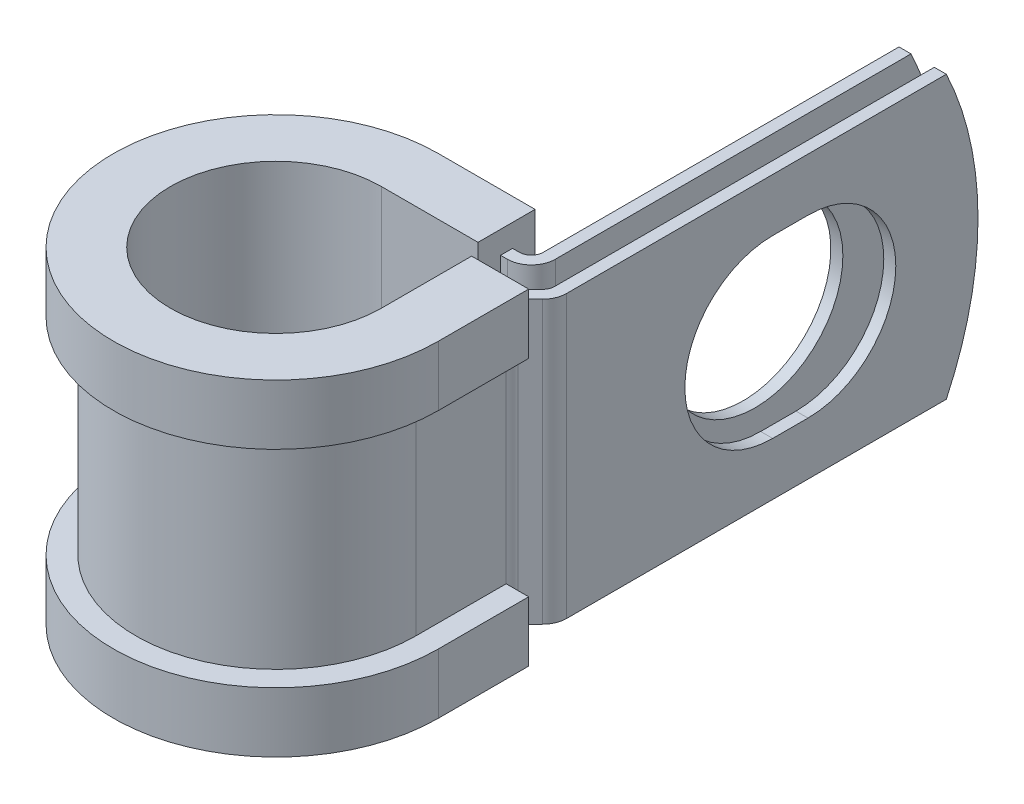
ISO-10303-21;
HEADER;
FILE_DESCRIPTION(('STEP AP214'),'2;1');
FILE_NAME('part.step','',(''),(''),'','','');
FILE_SCHEMA(('AUTOMOTIVE_DESIGN { 1 0 10303 214 1 1 1 1 }'));
ENDSEC;
DATA;
#1=APPLICATION_CONTEXT('core data for automotive mechanical design processes');
#2=APPLICATION_PROTOCOL_DEFINITION('international standard','automotive_design',2000,#1);
#3=PRODUCT_CONTEXT('',#1,'mechanical');
#4=PRODUCT('Part','Part','',(#3));
#5=PRODUCT_RELATED_PRODUCT_CATEGORY('part','',(#4));
#6=PRODUCT_DEFINITION_FORMATION('','',#4);
#7=PRODUCT_DEFINITION_CONTEXT('part definition',#1,'design');
#8=PRODUCT_DEFINITION('design','',#6,#7);
#9=PRODUCT_DEFINITION_SHAPE('','',#8);
#10=(LENGTH_UNIT() NAMED_UNIT(*) SI_UNIT(.MILLI.,.METRE.));
#11=(NAMED_UNIT(*) PLANE_ANGLE_UNIT() SI_UNIT($,.RADIAN.));
#12=(NAMED_UNIT(*) SI_UNIT($,.STERADIAN.) SOLID_ANGLE_UNIT());
#13=UNCERTAINTY_MEASURE_WITH_UNIT(LENGTH_MEASURE(1.E-05),#10,'distance_accuracy_value','');
#14=(GEOMETRIC_REPRESENTATION_CONTEXT(3) GLOBAL_UNCERTAINTY_ASSIGNED_CONTEXT((#13)) GLOBAL_UNIT_ASSIGNED_CONTEXT((#10,
#11,#12)) REPRESENTATION_CONTEXT('',''));
#15=CARTESIAN_POINT('',(0.,0.,0.));
#16=DIRECTION('',(0.,0.,1.));
#17=DIRECTION('',(1.,0.,0.));
#18=AXIS2_PLACEMENT_3D('',#15,#16,#17);
#19=CARTESIAN_POINT('',(9.38897438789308,-9.525,-8.6614));
#20=DIRECTION('',(0.,1.,0.));
#21=DIRECTION('',(1.,0.,0.));
#22=AXIS2_PLACEMENT_3D('',#19,#20,#21);
#23=PLANE('',#22);
#24=DIRECTION('',(0.,0.,-1.));
#25=VECTOR('',#24,1.);
#26=CARTESIAN_POINT('',(6.54417438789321,-9.525,-8.6614));
#27=LINE('',#26,#25);
#28=CARTESIAN_POINT('',(6.54417438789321,-9.525,-8.6614));
#29=VERTEX_POINT('',#28);
#30=CARTESIAN_POINT('',(6.54417438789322,-9.525,-9.4742));
#31=VERTEX_POINT('',#30);
#32=EDGE_CURVE('E523',#29,#31,#27,.T.);
#33=ORIENTED_EDGE('',*,*,#32,.T.);
#34=DIRECTION('',(1.,0.,0.));
#35=VECTOR('',#34,1.);
#36=CARTESIAN_POINT('',(0.,-9.525,-9.4742));
#37=LINE('',#36,#35);
#38=CARTESIAN_POINT('',(7.00137438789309,-9.525,-9.4742));
#39=VERTEX_POINT('',#38);
#40=EDGE_CURVE('E410',#39,#31,#37,.F.);
#41=ORIENTED_EDGE('',*,*,#40,.F.);
#42=CARTESIAN_POINT('',(7.00137438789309,-9.525,-10.287));
#43=DIRECTION('',(0.,1.,0.));
#44=DIRECTION('',(1.,0.,0.));
#45=AXIS2_PLACEMENT_3D('',#42,#43,#44);
#46=CIRCLE('',#45,0.8128);
#47=CARTESIAN_POINT('',(7.81417438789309,-9.525,-10.287));
#48=VERTEX_POINT('',#47);
#49=EDGE_CURVE('E408',#48,#39,#46,.F.);
#50=ORIENTED_EDGE('',*,*,#49,.F.);
#51=DIRECTION('',(0.,0.,1.));
#52=VECTOR('',#51,1.);
#53=CARTESIAN_POINT('',(7.81417438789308,-9.525,-36.4998));
#54=LINE('',#53,#52);
#55=CARTESIAN_POINT('',(7.81417438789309,-9.525,-34.3552631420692));
#56=VERTEX_POINT('',#55);
#57=EDGE_CURVE('E406',#56,#48,#54,.T.);
#58=ORIENTED_EDGE('',*,*,#57,.F.);
#59=DIRECTION('',(-1.,0.,0.));
#60=VECTOR('',#59,1.);
#61=CARTESIAN_POINT('',(11.0145743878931,-9.525,-34.3552631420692));
#62=LINE('',#61,#60);
#63=CARTESIAN_POINT('',(8.62697438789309,-9.525,-34.3552631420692));
#64=VERTEX_POINT('',#63);
#65=EDGE_CURVE('E12',#64,#56,#62,.T.);
#66=ORIENTED_EDGE('',*,*,#65,.F.);
#67=DIRECTION('',(0.,0.,1.));
#68=VECTOR('',#67,1.);
#69=CARTESIAN_POINT('',(8.62697438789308,-9.525,-36.4998));
#70=LINE('',#69,#68);
#71=CARTESIAN_POINT('',(8.62697438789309,-9.525,-10.287));
#72=VERTEX_POINT('',#71);
#73=EDGE_CURVE('E404',#64,#72,#70,.T.);
#74=ORIENTED_EDGE('',*,*,#73,.T.);
#75=CARTESIAN_POINT('',(7.00137438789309,-9.525,-10.287));
#76=DIRECTION('',(0.,-1.,0.));
#77=DIRECTION('',(0.,0.,1.));
#78=AXIS2_PLACEMENT_3D('',#75,#76,#77);
#79=CIRCLE('',#78,1.6256);
#80=CARTESIAN_POINT('',(7.00137438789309,-9.525,-8.6614));
#81=VERTEX_POINT('',#80);
#82=EDGE_CURVE('E401',#72,#81,#79,.T.);
#83=ORIENTED_EDGE('',*,*,#82,.T.);
#84=DIRECTION('',(-1.,0.,0.));
#85=VECTOR('',#84,1.);
#86=CARTESIAN_POINT('',(0.,-9.525,-8.6614));
#87=LINE('',#86,#85);
#88=EDGE_CURVE('E398',#81,#29,#87,.T.);
#89=ORIENTED_EDGE('',*,*,#88,.T.);
#90=EDGE_LOOP('',(#33,#41,#50,#58,#66,#74,#83,#89));
#91=FACE_BOUND('',#90,.T.);
#92=ADVANCED_FACE('F54',(#91),#23,.F.);
#93=CARTESIAN_POINT('',(9.38897438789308,9.525,-8.6614));
#94=DIRECTION('',(0.,1.,0.));
#95=DIRECTION('',(1.,0.,0.));
#96=AXIS2_PLACEMENT_3D('',#93,#94,#95);
#97=PLANE('',#96);
#98=DIRECTION('',(1.,0.,0.));
#99=VECTOR('',#98,1.);
#100=CARTESIAN_POINT('',(0.,9.525,-9.4742));
#101=LINE('',#100,#99);
#102=CARTESIAN_POINT('',(7.00137438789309,9.525,-9.4742));
#103=VERTEX_POINT('',#102);
#104=CARTESIAN_POINT('',(6.54417438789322,9.525,-9.4742));
#105=VERTEX_POINT('',#104);
#106=EDGE_CURVE('E368',#103,#105,#101,.F.);
#107=ORIENTED_EDGE('',*,*,#106,.T.);
#108=DIRECTION('',(0.,0.,1.));
#109=VECTOR('',#108,1.);
#110=CARTESIAN_POINT('',(6.54417438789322,9.525,-9.4742));
#111=LINE('',#110,#109);
#112=CARTESIAN_POINT('',(6.54417438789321,9.525,-8.6614));
#113=VERTEX_POINT('',#112);
#114=EDGE_CURVE('E517',#105,#113,#111,.T.);
#115=ORIENTED_EDGE('',*,*,#114,.T.);
#116=DIRECTION('',(-1.,0.,0.));
#117=VECTOR('',#116,1.);
#118=CARTESIAN_POINT('',(0.,9.525,-8.6614));
#119=LINE('',#118,#117);
#120=CARTESIAN_POINT('',(7.00137438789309,9.525,-8.6614));
#121=VERTEX_POINT('',#120);
#122=EDGE_CURVE('E625',#121,#113,#119,.T.);
#123=ORIENTED_EDGE('',*,*,#122,.F.);
#124=CARTESIAN_POINT('',(7.00137438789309,9.525,-10.287));
#125=DIRECTION('',(0.,-1.,0.));
#126=DIRECTION('',(0.,0.,1.));
#127=AXIS2_PLACEMENT_3D('',#124,#125,#126);
#128=CIRCLE('',#127,1.6256);
#129=CARTESIAN_POINT('',(8.62697438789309,9.525,-10.287));
#130=VERTEX_POINT('',#129);
#131=EDGE_CURVE('E370',#130,#121,#128,.T.);
#132=ORIENTED_EDGE('',*,*,#131,.F.);
#133=DIRECTION('',(0.,0.,1.));
#134=VECTOR('',#133,1.);
#135=CARTESIAN_POINT('',(8.62697438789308,9.525,-36.4998));
#136=LINE('',#135,#134);
#137=CARTESIAN_POINT('',(8.62697438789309,9.525,-34.3552631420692));
#138=VERTEX_POINT('',#137);
#139=EDGE_CURVE('E361',#138,#130,#136,.T.);
#140=ORIENTED_EDGE('',*,*,#139,.F.);
#141=DIRECTION('',(-1.,0.,0.));
#142=VECTOR('',#141,1.);
#143=CARTESIAN_POINT('',(11.0145743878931,9.525,-34.3552631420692));
#144=LINE('',#143,#142);
#145=CARTESIAN_POINT('',(7.81417438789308,9.525,-34.3552631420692));
#146=VERTEX_POINT('',#145);
#147=EDGE_CURVE('E62',#138,#146,#144,.T.);
#148=ORIENTED_EDGE('',*,*,#147,.T.);
#149=DIRECTION('',(0.,0.,1.));
#150=VECTOR('',#149,1.);
#151=CARTESIAN_POINT('',(7.81417438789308,9.525,-36.4998));
#152=LINE('',#151,#150);
#153=CARTESIAN_POINT('',(7.81417438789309,9.525,-10.287));
#154=VERTEX_POINT('',#153);
#155=EDGE_CURVE('E358',#146,#154,#152,.T.);
#156=ORIENTED_EDGE('',*,*,#155,.T.);
#157=CARTESIAN_POINT('',(7.00137438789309,9.525,-10.287));
#158=DIRECTION('',(0.,1.,0.));
#159=DIRECTION('',(1.,0.,0.));
#160=AXIS2_PLACEMENT_3D('',#157,#158,#159);
#161=CIRCLE('',#160,0.8128);
#162=EDGE_CURVE('E366',#154,#103,#161,.F.);
#163=ORIENTED_EDGE('',*,*,#162,.T.);
#164=EDGE_LOOP('',(#107,#115,#123,#132,#140,#148,#156,#163));
#165=FACE_BOUND('',#164,.T.);
#166=ADVANCED_FACE('F357',(#165),#97,.T.);
#167=CARTESIAN_POINT('',(0.,9.525,-8.6614));
#168=DIRECTION('',(0.,0.,1.));
#169=DIRECTION('',(1.,0.,0.));
#170=AXIS2_PLACEMENT_3D('',#167,#168,#169);
#171=PLANE('',#170);
#172=ORIENTED_EDGE('',*,*,#122,.T.);
#173=DIRECTION('',(0.,-1.,0.));
#174=VECTOR('',#173,1.);
#175=CARTESIAN_POINT('',(6.54417438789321,9.525,-8.6614));
#176=LINE('',#175,#174);
#177=EDGE_CURVE('E520',#113,#29,#176,.T.);
#178=ORIENTED_EDGE('',*,*,#177,.T.);
#179=ORIENTED_EDGE('',*,*,#88,.F.);
#180=DIRECTION('',(0.,-1.,0.));
#181=VECTOR('',#180,1.);
#182=CARTESIAN_POINT('',(7.00137438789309,9.525,-8.6614));
#183=LINE('',#182,#181);
#184=EDGE_CURVE('E344',#121,#81,#183,.T.);
#185=ORIENTED_EDGE('',*,*,#184,.F.);
#186=EDGE_LOOP('',(#172,#178,#179,#185));
#187=FACE_BOUND('',#186,.T.);
#188=ADVANCED_FACE('F635',(#187),#171,.T.);
#189=CARTESIAN_POINT('',(11.0145743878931,9.525,-8.6614));
#190=DIRECTION('',(-1.,0.,0.));
#191=DIRECTION('',(0.,0.,1.));
#192=AXIS2_PLACEMENT_3D('',#189,#190,#191);
#193=PLANE('',#192);
#194=CARTESIAN_POINT('',(11.0145743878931,0.,-24.9935999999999));
#195=DIRECTION('',(1.,0.,0.));
#196=DIRECTION('',(0.,0.,-1.));
#197=AXIS2_PLACEMENT_3D('',#194,#195,#196);
#198=CIRCLE('',#197,5.9436);
#199=CARTESIAN_POINT('',(11.0145743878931,-5.9436,-24.9936000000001));
#200=VERTEX_POINT('',#199);
#201=CARTESIAN_POINT('',(11.0145743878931,5.9436,-24.9936000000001));
#202=VERTEX_POINT('',#201);
#203=EDGE_CURVE('E580',#200,#202,#198,.T.);
#204=ORIENTED_EDGE('',*,*,#203,.F.);
#205=DIRECTION('',(0.,0.,-1.));
#206=VECTOR('',#205,1.);
#207=CARTESIAN_POINT('',(11.0145743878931,-5.9436,-22.6059999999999));
#208=LINE('',#207,#206);
#209=CARTESIAN_POINT('',(11.0145743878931,-5.9436,-22.6059999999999));
#210=VERTEX_POINT('',#209);
#211=EDGE_CURVE('E583',#210,#200,#208,.T.);
#212=ORIENTED_EDGE('',*,*,#211,.F.);
#213=CARTESIAN_POINT('',(11.0145743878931,0.,-22.6059999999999));
#214=DIRECTION('',(1.,0.,0.));
#215=DIRECTION('',(0.,0.,-1.));
#216=AXIS2_PLACEMENT_3D('',#213,#214,#215);
#217=CIRCLE('',#216,5.9436);
#218=CARTESIAN_POINT('',(11.0145743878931,5.9436,-22.6059999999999));
#219=VERTEX_POINT('',#218);
#220=EDGE_CURVE('E576',#219,#210,#217,.T.);
#221=ORIENTED_EDGE('',*,*,#220,.F.);
#222=DIRECTION('',(0.,0.,1.));
#223=VECTOR('',#222,1.);
#224=CARTESIAN_POINT('',(11.0145743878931,5.9436,-22.6059999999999));
#225=LINE('',#224,#223);
#226=EDGE_CURVE('E577',#202,#219,#225,.T.);
#227=ORIENTED_EDGE('',*,*,#226,.F.);
#228=EDGE_LOOP('',(#204,#212,#221,#227));
#229=FACE_BOUND('',#228,.T.);
#230=DIRECTION('',(0.,0.,-1.));
#231=VECTOR('',#230,1.);
#232=CARTESIAN_POINT('',(11.0145743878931,-9.525,-8.6614));
#233=LINE('',#232,#231);
#234=CARTESIAN_POINT('',(11.0145743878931,-9.525,-8.6614));
#235=VERTEX_POINT('',#234);
#236=CARTESIAN_POINT('',(11.0145743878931,-9.525,-34.3552631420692));
#237=VERTEX_POINT('',#236);
#238=EDGE_CURVE('E382',#235,#237,#233,.T.);
#239=ORIENTED_EDGE('',*,*,#238,.T.);
#240=CARTESIAN_POINT('',(11.0145743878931,0.,-14.2748));
#241=DIRECTION('',(-1.,0.,0.));
#242=DIRECTION('',(0.,0.,1.));
#243=AXIS2_PLACEMENT_3D('',#240,#241,#242);
#244=CIRCLE('',#243,22.225);
#245=CARTESIAN_POINT('',(11.0145743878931,9.525,-34.3552631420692));
#246=VERTEX_POINT('',#245);
#247=EDGE_CURVE('E568',#246,#237,#244,.T.);
#248=ORIENTED_EDGE('',*,*,#247,.F.);
#249=DIRECTION('',(0.,0.,-1.));
#250=VECTOR('',#249,1.);
#251=CARTESIAN_POINT('',(11.0145743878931,9.525,-8.6614));
#252=LINE('',#251,#250);
#253=CARTESIAN_POINT('',(11.0145743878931,9.525,-8.6614));
#254=VERTEX_POINT('',#253);
#255=EDGE_CURVE('E419',#254,#246,#252,.T.);
#256=ORIENTED_EDGE('',*,*,#255,.F.);
#257=DIRECTION('',(0.,-1.,0.));
#258=VECTOR('',#257,1.);
#259=CARTESIAN_POINT('',(11.0145743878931,9.525,-8.6614));
#260=LINE('',#259,#258);
#261=EDGE_CURVE('E381',#254,#235,#260,.T.);
#262=ORIENTED_EDGE('',*,*,#261,.T.);
#263=EDGE_LOOP('',(#239,#248,#256,#262));
#264=FACE_BOUND('',#263,.T.);
#265=ADVANCED_FACE('F56',(#229,#264),#193,.F.);
#266=CARTESIAN_POINT('',(10.2017743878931,9.525,-8.6614));
#267=DIRECTION('',(-1.,0.,0.));
#268=DIRECTION('',(0.,0.,1.));
#269=AXIS2_PLACEMENT_3D('',#266,#267,#268);
#270=PLANE('',#269);
#271=DIRECTION('',(0.,0.,-1.));
#272=VECTOR('',#271,1.);
#273=CARTESIAN_POINT('',(10.2017743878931,-5.9436,-22.6059999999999));
#274=LINE('',#273,#272);
#275=CARTESIAN_POINT('',(10.2017743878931,-5.9436,-22.6059999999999));
#276=VERTEX_POINT('',#275);
#277=CARTESIAN_POINT('',(10.2017743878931,-5.9436,-24.9936000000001));
#278=VERTEX_POINT('',#277);
#279=EDGE_CURVE('E579',#276,#278,#274,.T.);
#280=ORIENTED_EDGE('',*,*,#279,.T.);
#281=CARTESIAN_POINT('',(10.2017743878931,0.,-24.9935999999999));
#282=DIRECTION('',(-1.,0.,0.));
#283=DIRECTION('',(0.,0.,1.));
#284=AXIS2_PLACEMENT_3D('',#281,#282,#283);
#285=CIRCLE('',#284,5.9436);
#286=CARTESIAN_POINT('',(10.2017743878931,5.9436,-24.9936000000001));
#287=VERTEX_POINT('',#286);
#288=EDGE_CURVE('E600',#278,#287,#285,.F.);
#289=ORIENTED_EDGE('',*,*,#288,.T.);
#290=DIRECTION('',(0.,0.,1.));
#291=VECTOR('',#290,1.);
#292=CARTESIAN_POINT('',(10.2017743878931,5.9436,-22.6059999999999));
#293=LINE('',#292,#291);
#294=CARTESIAN_POINT('',(10.2017743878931,5.9436,-22.6059999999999));
#295=VERTEX_POINT('',#294);
#296=EDGE_CURVE('E596',#287,#295,#293,.T.);
#297=ORIENTED_EDGE('',*,*,#296,.T.);
#298=CARTESIAN_POINT('',(10.2017743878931,0.,-22.6059999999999));
#299=DIRECTION('',(-1.,0.,0.));
#300=DIRECTION('',(0.,0.,1.));
#301=AXIS2_PLACEMENT_3D('',#298,#299,#300);
#302=CIRCLE('',#301,5.9436);
#303=EDGE_CURVE('E591',#295,#276,#302,.F.);
#304=ORIENTED_EDGE('',*,*,#303,.T.);
#305=EDGE_LOOP('',(#280,#289,#297,#304));
#306=FACE_BOUND('',#305,.T.);
#307=CARTESIAN_POINT('',(10.2017743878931,0.,-14.2748));
#308=DIRECTION('',(-1.,0.,0.));
#309=DIRECTION('',(0.,0.,1.));
#310=AXIS2_PLACEMENT_3D('',#307,#308,#309);
#311=CIRCLE('',#310,22.225);
#312=CARTESIAN_POINT('',(10.2017743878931,9.525,-34.3552631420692));
#313=VERTEX_POINT('',#312);
#314=CARTESIAN_POINT('',(10.2017743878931,-9.525,-34.3552631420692));
#315=VERTEX_POINT('',#314);
#316=EDGE_CURVE('E76',#313,#315,#311,.T.);
#317=ORIENTED_EDGE('',*,*,#316,.T.);
#318=DIRECTION('',(0.,0.,-1.));
#319=VECTOR('',#318,1.);
#320=CARTESIAN_POINT('',(10.2017743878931,-9.525,-8.6614));
#321=LINE('',#320,#319);
#322=CARTESIAN_POINT('',(10.2017743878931,-9.525,-8.6614));
#323=VERTEX_POINT('',#322);
#324=EDGE_CURVE('E385',#323,#315,#321,.T.);
#325=ORIENTED_EDGE('',*,*,#324,.F.);
#326=DIRECTION('',(0.,-1.,0.));
#327=VECTOR('',#326,1.);
#328=CARTESIAN_POINT('',(10.2017743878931,9.525,-8.6614));
#329=LINE('',#328,#327);
#330=CARTESIAN_POINT('',(10.2017743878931,9.525,-8.6614));
#331=VERTEX_POINT('',#330);
#332=EDGE_CURVE('E352',#331,#323,#329,.T.);
#333=ORIENTED_EDGE('',*,*,#332,.F.);
#334=DIRECTION('',(0.,0.,-1.));
#335=VECTOR('',#334,1.);
#336=CARTESIAN_POINT('',(10.2017743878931,9.525,-8.6614));
#337=LINE('',#336,#335);
#338=EDGE_CURVE('E615',#331,#313,#337,.T.);
#339=ORIENTED_EDGE('',*,*,#338,.T.);
#340=EDGE_LOOP('',(#317,#325,#333,#339));
#341=FACE_BOUND('',#340,.T.);
#342=ADVANCED_FACE('F689',(#306,#341),#270,.T.);
#343=CARTESIAN_POINT('',(8.62697438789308,9.525,-36.4998));
#344=DIRECTION('',(1.,0.,0.));
#345=DIRECTION('',(0.,0.,-1.));
#346=AXIS2_PLACEMENT_3D('',#343,#344,#345);
#347=PLANE('',#346);
#348=CARTESIAN_POINT('',(8.62697438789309,0.,-23.7998));
#349=DIRECTION('',(1.,0.,0.));
#350=DIRECTION('',(0.,0.,-1.));
#351=AXIS2_PLACEMENT_3D('',#348,#349,#350);
#352=CIRCLE('',#351,5.9436);
#353=CARTESIAN_POINT('',(8.62697438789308,0.,-29.7434));
#354=VERTEX_POINT('',#353);
#355=EDGE_CURVE('E386',#354,#354,#352,.F.);
#356=ORIENTED_EDGE('',*,*,#355,.T.);
#357=EDGE_LOOP('',(#356));
#358=FACE_BOUND('',#357,.T.);
#359=ORIENTED_EDGE('',*,*,#73,.F.);
#360=CARTESIAN_POINT('',(8.62697438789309,0.,-14.2748));
#361=DIRECTION('',(1.,0.,0.));
#362=DIRECTION('',(0.,0.,-1.));
#363=AXIS2_PLACEMENT_3D('',#360,#361,#362);
#364=CIRCLE('',#363,22.225);
#365=EDGE_CURVE('E573',#64,#138,#364,.T.);
#366=ORIENTED_EDGE('',*,*,#365,.T.);
#367=ORIENTED_EDGE('',*,*,#139,.T.);
#368=DIRECTION('',(0.,-1.,0.));
#369=VECTOR('',#368,1.);
#370=CARTESIAN_POINT('',(8.62697438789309,9.525,-10.287));
#371=LINE('',#370,#369);
#372=EDGE_CURVE('E341',#130,#72,#371,.T.);
#373=ORIENTED_EDGE('',*,*,#372,.T.);
#374=EDGE_LOOP('',(#359,#366,#367,#373));
#375=FACE_BOUND('',#374,.T.);
#376=ADVANCED_FACE('F641',(#358,#375),#347,.T.);
#377=CARTESIAN_POINT('',(7.81417438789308,9.525,-36.4998));
#378=DIRECTION('',(1.,0.,0.));
#379=DIRECTION('',(0.,0.,-1.));
#380=AXIS2_PLACEMENT_3D('',#377,#378,#379);
#381=PLANE('',#380);
#382=CARTESIAN_POINT('',(7.81417438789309,0.,-23.7998));
#383=DIRECTION('',(-1.,0.,0.));
#384=DIRECTION('',(0.,0.,1.));
#385=AXIS2_PLACEMENT_3D('',#382,#383,#384);
#386=CIRCLE('',#385,5.9436);
#387=CARTESIAN_POINT('',(7.81417438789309,0.,-17.8562));
#388=VERTEX_POINT('',#387);
#389=EDGE_CURVE('E608',#388,#388,#386,.T.);
#390=ORIENTED_EDGE('',*,*,#389,.F.);
#391=EDGE_LOOP('',(#390));
#392=FACE_BOUND('',#391,.T.);
#393=CARTESIAN_POINT('',(7.81417438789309,0.,-14.2748));
#394=DIRECTION('',(-1.,0.,0.));
#395=DIRECTION('',(0.,0.,1.));
#396=AXIS2_PLACEMENT_3D('',#393,#394,#395);
#397=CIRCLE('',#396,22.225);
#398=EDGE_CURVE('E68',#146,#56,#397,.T.);
#399=ORIENTED_EDGE('',*,*,#398,.T.);
#400=ORIENTED_EDGE('',*,*,#57,.T.);
#401=DIRECTION('',(0.,-1.,0.));
#402=VECTOR('',#401,1.);
#403=CARTESIAN_POINT('',(7.81417438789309,9.525,-10.287));
#404=LINE('',#403,#402);
#405=EDGE_CURVE('E338',#154,#48,#404,.T.);
#406=ORIENTED_EDGE('',*,*,#405,.F.);
#407=ORIENTED_EDGE('',*,*,#155,.F.);
#408=EDGE_LOOP('',(#399,#400,#406,#407));
#409=FACE_BOUND('',#408,.T.);
#410=ADVANCED_FACE('F364',(#392,#409),#381,.F.);
#411=CARTESIAN_POINT('',(10.287,-9.525,-6.11100726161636));
#412=DIRECTION('',(0.,1.,0.));
#413=DIRECTION('',(1.,0.,0.));
#414=AXIS2_PLACEMENT_3D('',#411,#412,#413);
#415=CIRCLE('',#414,0.8128);
#416=CARTESIAN_POINT('',(9.4742,-9.525,-6.11100726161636));
#417=VERTEX_POINT('',#416);
#418=CARTESIAN_POINT('',(9.71226360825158,-9.525,-6.68574365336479));
#419=VERTEX_POINT('',#418);
#420=EDGE_CURVE('E413',#417,#419,#415,.F.);
#421=ORIENTED_EDGE('',*,*,#420,.F.);
#422=DIRECTION('',(1.,0.,0.));
#423=VECTOR('',#422,1.);
#424=CARTESIAN_POINT('',(8.6614,-9.525,-6.11100726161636));
#425=LINE('',#424,#423);
#426=CARTESIAN_POINT('',(8.6614,-9.525,-6.11100726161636));
#427=VERTEX_POINT('',#426);
#428=EDGE_CURVE('E451',#427,#417,#425,.T.);
#429=ORIENTED_EDGE('',*,*,#428,.F.);
#430=CARTESIAN_POINT('',(10.287,-9.525,-6.11100726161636));
#431=DIRECTION('',(0.,-1.,0.));
#432=DIRECTION('',(0.,0.,1.));
#433=AXIS2_PLACEMENT_3D('',#430,#431,#432);
#434=CIRCLE('',#433,1.6256);
#435=CARTESIAN_POINT('',(9.13752721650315,-9.525,-7.26048004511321));
#436=VERTEX_POINT('',#435);
#437=EDGE_CURVE('E395',#427,#436,#434,.T.);
#438=ORIENTED_EDGE('',*,*,#437,.T.);
#439=DIRECTION('',(0.707106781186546,0.,-0.707106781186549));
#440=VECTOR('',#439,1.);
#441=CARTESIAN_POINT('',(9.13752721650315,-9.525,-7.26048004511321));
#442=LINE('',#441,#440);
#443=CARTESIAN_POINT('',(9.96371077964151,-9.525,-8.08666360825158));
#444=VERTEX_POINT('',#443);
#445=EDGE_CURVE('E392',#436,#444,#442,.T.);
#446=ORIENTED_EDGE('',*,*,#445,.T.);
#447=CARTESIAN_POINT('',(9.38897438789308,-9.525,-8.6614));
#448=DIRECTION('',(0.,1.,0.));
#449=DIRECTION('',(0.,0.,1.));
#450=AXIS2_PLACEMENT_3D('',#447,#448,#449);
#451=CIRCLE('',#450,0.812799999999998);
#452=EDGE_CURVE('E389',#444,#323,#451,.T.);
#453=ORIENTED_EDGE('',*,*,#452,.T.);
#454=ORIENTED_EDGE('',*,*,#324,.T.);
#455=DIRECTION('',(-1.,0.,0.));
#456=VECTOR('',#455,1.);
#457=CARTESIAN_POINT('',(11.0145743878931,-9.525,-34.3552631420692));
#458=LINE('',#457,#456);
#459=EDGE_CURVE('E566',#237,#315,#458,.T.);
#460=ORIENTED_EDGE('',*,*,#459,.F.);
#461=ORIENTED_EDGE('',*,*,#238,.F.);
#462=CARTESIAN_POINT('',(9.38897438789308,-9.525,-8.6614));
#463=DIRECTION('',(0.,1.,0.));
#464=DIRECTION('',(1.,0.,0.));
#465=AXIS2_PLACEMENT_3D('',#462,#463,#464);
#466=CIRCLE('',#465,1.6256);
#467=CARTESIAN_POINT('',(10.5384471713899,-9.525,-7.51192721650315));
#468=VERTEX_POINT('',#467);
#469=EDGE_CURVE('E417',#468,#235,#466,.T.);
#470=ORIENTED_EDGE('',*,*,#469,.F.);
#471=DIRECTION('',(0.707106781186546,0.,-0.707106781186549));
#472=VECTOR('',#471,1.);
#473=CARTESIAN_POINT('',(9.71226360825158,-9.525,-6.68574365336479));
#474=LINE('',#473,#472);
#475=EDGE_CURVE('E415',#419,#468,#474,.T.);
#476=ORIENTED_EDGE('',*,*,#475,.F.);
#477=EDGE_LOOP('',(#421,#429,#438,#446,#453,#454,#460,#461,#470,#476));
#478=FACE_BOUND('',#477,.T.);
#479=ADVANCED_FACE('F675',(#478),#23,.F.);
#480=DIRECTION('',(-1.,0.,0.));
#481=VECTOR('',#480,1.);
#482=CARTESIAN_POINT('',(9.4742,9.525,-6.11100726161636));
#483=LINE('',#482,#481);
#484=CARTESIAN_POINT('',(9.4742,9.525,-6.11100726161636));
#485=VERTEX_POINT('',#484);
#486=CARTESIAN_POINT('',(8.6614,9.525,-6.11100726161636));
#487=VERTEX_POINT('',#486);
#488=EDGE_CURVE('E440',#485,#487,#483,.T.);
#489=ORIENTED_EDGE('',*,*,#488,.F.);
#490=CARTESIAN_POINT('',(10.287,9.525,-6.11100726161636));
#491=DIRECTION('',(0.,1.,0.));
#492=DIRECTION('',(1.,0.,0.));
#493=AXIS2_PLACEMENT_3D('',#490,#491,#492);
#494=CIRCLE('',#493,0.8128);
#495=CARTESIAN_POINT('',(9.71226360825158,9.525,-6.68574365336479));
#496=VERTEX_POINT('',#495);
#497=EDGE_CURVE('E375',#485,#496,#494,.F.);
#498=ORIENTED_EDGE('',*,*,#497,.T.);
#499=DIRECTION('',(0.707106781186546,0.,-0.707106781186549));
#500=VECTOR('',#499,1.);
#501=CARTESIAN_POINT('',(9.71226360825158,9.525,-6.68574365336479));
#502=LINE('',#501,#500);
#503=CARTESIAN_POINT('',(10.5384471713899,9.525,-7.51192721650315));
#504=VERTEX_POINT('',#503);
#505=EDGE_CURVE('E377',#496,#504,#502,.T.);
#506=ORIENTED_EDGE('',*,*,#505,.T.);
#507=CARTESIAN_POINT('',(9.38897438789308,9.525,-8.6614));
#508=DIRECTION('',(0.,1.,0.));
#509=DIRECTION('',(1.,0.,0.));
#510=AXIS2_PLACEMENT_3D('',#507,#508,#509);
#511=CIRCLE('',#510,1.6256);
#512=EDGE_CURVE('E379',#504,#254,#511,.T.);
#513=ORIENTED_EDGE('',*,*,#512,.T.);
#514=ORIENTED_EDGE('',*,*,#255,.T.);
#515=DIRECTION('',(-1.,0.,0.));
#516=VECTOR('',#515,1.);
#517=CARTESIAN_POINT('',(11.0145743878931,9.525,-34.3552631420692));
#518=LINE('',#517,#516);
#519=EDGE_CURVE('E570',#246,#313,#518,.T.);
#520=ORIENTED_EDGE('',*,*,#519,.T.);
#521=ORIENTED_EDGE('',*,*,#338,.F.);
#522=CARTESIAN_POINT('',(9.38897438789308,9.525,-8.6614));
#523=DIRECTION('',(0.,1.,0.));
#524=DIRECTION('',(0.,0.,1.));
#525=AXIS2_PLACEMENT_3D('',#522,#523,#524);
#526=CIRCLE('',#525,0.812799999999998);
#527=CARTESIAN_POINT('',(9.96371077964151,9.525,-8.08666360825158));
#528=VERTEX_POINT('',#527);
#529=EDGE_CURVE('E618',#528,#331,#526,.T.);
#530=ORIENTED_EDGE('',*,*,#529,.F.);
#531=DIRECTION('',(0.707106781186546,0.,-0.707106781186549));
#532=VECTOR('',#531,1.);
#533=CARTESIAN_POINT('',(9.13752721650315,9.525,-7.26048004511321));
#534=LINE('',#533,#532);
#535=CARTESIAN_POINT('',(9.13752721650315,9.525,-7.26048004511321));
#536=VERTEX_POINT('',#535);
#537=EDGE_CURVE('E621',#536,#528,#534,.T.);
#538=ORIENTED_EDGE('',*,*,#537,.F.);
#539=CARTESIAN_POINT('',(10.287,9.525,-6.11100726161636));
#540=DIRECTION('',(0.,-1.,0.));
#541=DIRECTION('',(0.,0.,1.));
#542=AXIS2_PLACEMENT_3D('',#539,#540,#541);
#543=CIRCLE('',#542,1.6256);
#544=EDGE_CURVE('E450',#487,#536,#543,.T.);
#545=ORIENTED_EDGE('',*,*,#544,.F.);
#546=EDGE_LOOP('',(#489,#498,#506,#513,#514,#520,#521,#530,#538,#545));
#547=FACE_BOUND('',#546,.T.);
#548=ADVANCED_FACE('F447',(#547),#97,.T.);
#549=CARTESIAN_POINT('',(9.38897438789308,9.525,-8.6614));
#550=DIRECTION('',(0.,-1.,0.));
#551=DIRECTION('',(0.,0.,-1.));
#552=AXIS2_PLACEMENT_3D('',#549,#550,#551);
#553=CYLINDRICAL_SURFACE('',#552,0.812799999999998);
#554=ORIENTED_EDGE('',*,*,#452,.F.);
#555=DIRECTION('',(0.,-1.,0.));
#556=VECTOR('',#555,1.);
#557=CARTESIAN_POINT('',(9.96371077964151,9.525,-8.08666360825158));
#558=LINE('',#557,#556);
#559=EDGE_CURVE('E350',#528,#444,#558,.T.);
#560=ORIENTED_EDGE('',*,*,#559,.F.);
#561=ORIENTED_EDGE('',*,*,#529,.T.);
#562=ORIENTED_EDGE('',*,*,#332,.T.);
#563=EDGE_LOOP('',(#554,#560,#561,#562));
#564=FACE_BOUND('',#563,.T.);
#565=ADVANCED_FACE('F685',(#564),#553,.F.);
#566=CARTESIAN_POINT('',(9.13752721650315,9.525,-7.26048004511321));
#567=DIRECTION('',(-0.707106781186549,0.,-0.707106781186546));
#568=DIRECTION('',(-0.707106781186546,0.,0.707106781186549));
#569=AXIS2_PLACEMENT_3D('',#566,#567,#568);
#570=PLANE('',#569);
#571=ORIENTED_EDGE('',*,*,#445,.F.);
#572=DIRECTION('',(0.,-1.,0.));
#573=VECTOR('',#572,1.);
#574=CARTESIAN_POINT('',(9.13752721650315,9.525,-7.26048004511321));
#575=LINE('',#574,#573);
#576=EDGE_CURVE('E348',#536,#436,#575,.T.);
#577=ORIENTED_EDGE('',*,*,#576,.F.);
#578=ORIENTED_EDGE('',*,*,#537,.T.);
#579=ORIENTED_EDGE('',*,*,#559,.T.);
#580=EDGE_LOOP('',(#571,#577,#578,#579));
#581=FACE_BOUND('',#580,.T.);
#582=ADVANCED_FACE('F680',(#581),#570,.T.);
#583=CARTESIAN_POINT('',(10.287,9.525,-6.11100726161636));
#584=DIRECTION('',(0.,-1.,0.));
#585=DIRECTION('',(0.,0.,-1.));
#586=AXIS2_PLACEMENT_3D('',#583,#584,#585);
#587=CYLINDRICAL_SURFACE('',#586,1.6256);
#588=ORIENTED_EDGE('',*,*,#437,.F.);
#589=DIRECTION('',(0.,-1.,0.));
#590=VECTOR('',#589,1.);
#591=CARTESIAN_POINT('',(8.6614,9.525,-6.11100726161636));
#592=LINE('',#591,#590);
#593=EDGE_CURVE('E346',#487,#427,#592,.T.);
#594=ORIENTED_EDGE('',*,*,#593,.F.);
#595=ORIENTED_EDGE('',*,*,#544,.T.);
#596=ORIENTED_EDGE('',*,*,#576,.T.);
#597=EDGE_LOOP('',(#588,#594,#595,#596));
#598=FACE_BOUND('',#597,.T.);
#599=ADVANCED_FACE('F677',(#598),#587,.T.);
#600=CARTESIAN_POINT('',(7.00137438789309,9.525,-10.287));
#601=DIRECTION('',(0.,-1.,0.));
#602=DIRECTION('',(0.,0.,-1.));
#603=AXIS2_PLACEMENT_3D('',#600,#601,#602);
#604=CYLINDRICAL_SURFACE('',#603,1.6256);
#605=ORIENTED_EDGE('',*,*,#82,.F.);
#606=ORIENTED_EDGE('',*,*,#372,.F.);
#607=ORIENTED_EDGE('',*,*,#131,.T.);
#608=ORIENTED_EDGE('',*,*,#184,.T.);
#609=EDGE_LOOP('',(#605,#606,#607,#608));
#610=FACE_BOUND('',#609,.T.);
#611=ADVANCED_FACE('F631',(#610),#604,.T.);
#612=CARTESIAN_POINT('',(7.00137438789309,9.525,-10.287));
#613=DIRECTION('',(0.,-1.,0.));
#614=DIRECTION('',(0.,0.,-1.));
#615=AXIS2_PLACEMENT_3D('',#612,#613,#614);
#616=CYLINDRICAL_SURFACE('',#615,0.8128);
#617=ORIENTED_EDGE('',*,*,#49,.T.);
#618=DIRECTION('',(0.,-1.,0.));
#619=VECTOR('',#618,1.);
#620=CARTESIAN_POINT('',(7.00137438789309,9.525,-9.4742));
#621=LINE('',#620,#619);
#622=EDGE_CURVE('E329',#103,#39,#621,.T.);
#623=ORIENTED_EDGE('',*,*,#622,.F.);
#624=ORIENTED_EDGE('',*,*,#162,.F.);
#625=ORIENTED_EDGE('',*,*,#405,.T.);
#626=EDGE_LOOP('',(#617,#623,#624,#625));
#627=FACE_BOUND('',#626,.T.);
#628=ADVANCED_FACE('F646',(#627),#616,.F.);
#629=CARTESIAN_POINT('',(0.,9.525,-9.4742));
#630=DIRECTION('',(0.,0.,1.));
#631=DIRECTION('',(1.,0.,0.));
#632=AXIS2_PLACEMENT_3D('',#629,#630,#631);
#633=PLANE('',#632);
#634=DIRECTION('',(0.,-1.,0.));
#635=VECTOR('',#634,1.);
#636=CARTESIAN_POINT('',(0.,9.525,-9.4742));
#637=LINE('',#636,#635);
#638=CARTESIAN_POINT('',(1.32896097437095E-13,6.985,-9.4742));
#639=VERTEX_POINT('',#638);
#640=CARTESIAN_POINT('',(1.32896097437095E-13,-6.985,-9.4742));
#641=VERTEX_POINT('',#640);
#642=EDGE_CURVE('E320',#639,#641,#637,.T.);
#643=ORIENTED_EDGE('',*,*,#642,.F.);
#644=DIRECTION('',(1.,0.,0.));
#645=VECTOR('',#644,1.);
#646=CARTESIAN_POINT('',(1.32896097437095E-13,6.985,-9.4742));
#647=LINE('',#646,#645);
#648=CARTESIAN_POINT('',(6.54417438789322,6.985,-9.4742));
#649=VERTEX_POINT('',#648);
#650=EDGE_CURVE('E563',#639,#649,#647,.T.);
#651=ORIENTED_EDGE('',*,*,#650,.T.);
#652=DIRECTION('',(0.,1.,0.));
#653=VECTOR('',#652,1.);
#654=CARTESIAN_POINT('',(6.54417438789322,9.525,-9.4742));
#655=LINE('',#654,#653);
#656=EDGE_CURVE('E514',#649,#105,#655,.T.);
#657=ORIENTED_EDGE('',*,*,#656,.T.);
#658=ORIENTED_EDGE('',*,*,#106,.F.);
#659=ORIENTED_EDGE('',*,*,#622,.T.);
#660=ORIENTED_EDGE('',*,*,#40,.T.);
#661=DIRECTION('',(0.,1.,0.));
#662=VECTOR('',#661,1.);
#663=CARTESIAN_POINT('',(6.54417438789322,-9.525,-9.4742));
#664=LINE('',#663,#662);
#665=CARTESIAN_POINT('',(6.54417438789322,-6.985,-9.4742));
#666=VERTEX_POINT('',#665);
#667=EDGE_CURVE('E526',#31,#666,#664,.T.);
#668=ORIENTED_EDGE('',*,*,#667,.T.);
#669=DIRECTION('',(1.,0.,0.));
#670=VECTOR('',#669,1.);
#671=CARTESIAN_POINT('',(1.32896097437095E-13,-6.985,-9.4742));
#672=LINE('',#671,#670);
#673=EDGE_CURVE('E543',#641,#666,#672,.T.);
#674=ORIENTED_EDGE('',*,*,#673,.F.);
#675=EDGE_LOOP('',(#643,#651,#657,#658,#659,#660,#668,#674));
#676=FACE_BOUND('',#675,.T.);
#677=ADVANCED_FACE('F650',(#676),#633,.F.);
#678=CARTESIAN_POINT('',(0.,9.525,0.));
#679=DIRECTION('',(0.,-1.,0.));
#680=DIRECTION('',(0.,0.,-1.));
#681=AXIS2_PLACEMENT_3D('',#678,#679,#680);
#682=CYLINDRICAL_SURFACE('',#681,9.4742);
#683=DIRECTION('',(0.,-1.,0.));
#684=VECTOR('',#683,1.);
#685=CARTESIAN_POINT('',(9.4742,9.525,0.));
#686=LINE('',#685,#684);
#687=CARTESIAN_POINT('',(9.4742,6.985,0.));
#688=VERTEX_POINT('',#687);
#689=CARTESIAN_POINT('',(9.4742,-6.985,0.));
#690=VERTEX_POINT('',#689);
#691=EDGE_CURVE('E318',#688,#690,#686,.T.);
#692=ORIENTED_EDGE('',*,*,#691,.F.);
#693=CARTESIAN_POINT('',(0.,6.985,0.));
#694=DIRECTION('',(0.,-1.,0.));
#695=DIRECTION('',(0.,0.,-1.));
#696=AXIS2_PLACEMENT_3D('',#693,#694,#695);
#697=CIRCLE('',#696,9.4742);
#698=EDGE_CURVE('E512',#688,#639,#697,.T.);
#699=ORIENTED_EDGE('',*,*,#698,.T.);
#700=ORIENTED_EDGE('',*,*,#642,.T.);
#701=CARTESIAN_POINT('',(0.,-6.985,0.));
#702=DIRECTION('',(0.,-1.,0.));
#703=DIRECTION('',(0.,0.,-1.));
#704=AXIS2_PLACEMENT_3D('',#701,#702,#703);
#705=CIRCLE('',#704,9.4742);
#706=EDGE_CURVE('E301',#690,#641,#705,.T.);
#707=ORIENTED_EDGE('',*,*,#706,.F.);
#708=EDGE_LOOP('',(#692,#699,#700,#707));
#709=FACE_BOUND('',#708,.T.);
#710=ADVANCED_FACE('F316',(#709),#682,.T.);
#711=CARTESIAN_POINT('',(9.4742,9.525,0.));
#712=DIRECTION('',(-1.,0.,0.));
#713=DIRECTION('',(0.,0.,1.));
#714=AXIS2_PLACEMENT_3D('',#711,#712,#713);
#715=PLANE('',#714);
#716=DIRECTION('',(0.,-1.,0.));
#717=VECTOR('',#716,1.);
#718=CARTESIAN_POINT('',(9.4742,9.525,-6.11100726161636));
#719=LINE('',#718,#717);
#720=CARTESIAN_POINT('',(9.4742,6.985,-6.11100726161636));
#721=VERTEX_POINT('',#720);
#722=CARTESIAN_POINT('',(9.4742,-6.985,-6.11100726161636));
#723=VERTEX_POINT('',#722);
#724=EDGE_CURVE('E332',#721,#723,#719,.T.);
#725=ORIENTED_EDGE('',*,*,#724,.F.);
#726=DIRECTION('',(0.,0.,-1.));
#727=VECTOR('',#726,1.);
#728=CARTESIAN_POINT('',(9.4742,6.985,0.));
#729=LINE('',#728,#727);
#730=EDGE_CURVE('E326',#688,#721,#729,.T.);
#731=ORIENTED_EDGE('',*,*,#730,.F.);
#732=ORIENTED_EDGE('',*,*,#691,.T.);
#733=DIRECTION('',(0.,0.,-1.));
#734=VECTOR('',#733,1.);
#735=CARTESIAN_POINT('',(9.4742,-6.985,0.));
#736=LINE('',#735,#734);
#737=EDGE_CURVE('E297',#690,#723,#736,.T.);
#738=ORIENTED_EDGE('',*,*,#737,.T.);
#739=EDGE_LOOP('',(#725,#731,#732,#738));
#740=FACE_BOUND('',#739,.T.);
#741=ADVANCED_FACE('F325',(#740),#715,.F.);
#742=CARTESIAN_POINT('',(10.287,9.525,-6.11100726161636));
#743=DIRECTION('',(0.,-1.,0.));
#744=DIRECTION('',(0.,0.,-1.));
#745=AXIS2_PLACEMENT_3D('',#742,#743,#744);
#746=CYLINDRICAL_SURFACE('',#745,0.8128);
#747=ORIENTED_EDGE('',*,*,#420,.T.);
#748=DIRECTION('',(0.,-1.,0.));
#749=VECTOR('',#748,1.);
#750=CARTESIAN_POINT('',(9.71226360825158,9.525,-6.68574365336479));
#751=LINE('',#750,#749);
#752=EDGE_CURVE('E424',#496,#419,#751,.T.);
#753=ORIENTED_EDGE('',*,*,#752,.F.);
#754=ORIENTED_EDGE('',*,*,#497,.F.);
#755=EDGE_CURVE('E327',#485,#721,#719,.T.);
#756=ORIENTED_EDGE('',*,*,#755,.T.);
#757=ORIENTED_EDGE('',*,*,#724,.T.);
#758=DIRECTION('',(0.,1.,0.));
#759=VECTOR('',#758,1.);
#760=CARTESIAN_POINT('',(9.4742,-9.525,-6.11100726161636));
#761=LINE('',#760,#759);
#762=EDGE_CURVE('E433',#417,#723,#761,.T.);
#763=ORIENTED_EDGE('',*,*,#762,.F.);
#764=EDGE_LOOP('',(#747,#753,#754,#756,#757,#763));
#765=FACE_BOUND('',#764,.T.);
#766=ADVANCED_FACE('F432',(#765),#746,.F.);
#767=CARTESIAN_POINT('',(9.71226360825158,9.525,-6.68574365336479));
#768=DIRECTION('',(-0.707106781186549,0.,-0.707106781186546));
#769=DIRECTION('',(-0.707106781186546,0.,0.707106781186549));
#770=AXIS2_PLACEMENT_3D('',#767,#768,#769);
#771=PLANE('',#770);
#772=ORIENTED_EDGE('',*,*,#475,.T.);
#773=DIRECTION('',(0.,-1.,0.));
#774=VECTOR('',#773,1.);
#775=CARTESIAN_POINT('',(10.5384471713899,9.525,-7.51192721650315));
#776=LINE('',#775,#774);
#777=EDGE_CURVE('E422',#504,#468,#776,.T.);
#778=ORIENTED_EDGE('',*,*,#777,.F.);
#779=ORIENTED_EDGE('',*,*,#505,.F.);
#780=ORIENTED_EDGE('',*,*,#752,.T.);
#781=EDGE_LOOP('',(#772,#778,#779,#780));
#782=FACE_BOUND('',#781,.T.);
#783=ADVANCED_FACE('F701',(#782),#771,.F.);
#784=CARTESIAN_POINT('',(9.38897438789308,9.525,-8.6614));
#785=DIRECTION('',(0.,-1.,0.));
#786=DIRECTION('',(0.,0.,-1.));
#787=AXIS2_PLACEMENT_3D('',#784,#785,#786);
#788=CYLINDRICAL_SURFACE('',#787,1.6256);
#789=ORIENTED_EDGE('',*,*,#469,.T.);
#790=ORIENTED_EDGE('',*,*,#261,.F.);
#791=ORIENTED_EDGE('',*,*,#512,.F.);
#792=ORIENTED_EDGE('',*,*,#777,.T.);
#793=EDGE_LOOP('',(#789,#790,#791,#792));
#794=FACE_BOUND('',#793,.T.);
#795=ADVANCED_FACE('F699',(#794),#788,.T.);
#796=CARTESIAN_POINT('',(25.4380138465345,0.,-23.7998));
#797=DIRECTION('',(-1.,0.,0.));
#798=DIRECTION('',(0.,0.,1.));
#799=AXIS2_PLACEMENT_3D('',#796,#797,#798);
#800=CYLINDRICAL_SURFACE('',#799,5.9436);
#801=ORIENTED_EDGE('',*,*,#389,.T.);
#802=EDGE_LOOP('',(#801));
#803=FACE_BOUND('',#802,.T.);
#804=ORIENTED_EDGE('',*,*,#355,.F.);
#805=EDGE_LOOP('',(#804));
#806=FACE_BOUND('',#805,.T.);
#807=ADVANCED_FACE('F708',(#803,#806),#800,.F.);
#808=CARTESIAN_POINT('',(-8.37443186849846,-5.9436,-22.6059999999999));
#809=DIRECTION('',(0.,-1.,0.));
#810=DIRECTION('',(0.,0.,-1.));
#811=AXIS2_PLACEMENT_3D('',#808,#809,#810);
#812=PLANE('',#811);
#813=DIRECTION('',(1.,0.,0.));
#814=VECTOR('',#813,1.);
#815=CARTESIAN_POINT('',(-8.37443186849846,-5.9436,-22.6059999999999));
#816=LINE('',#815,#814);
#817=EDGE_CURVE('E594',#276,#210,#816,.T.);
#818=ORIENTED_EDGE('',*,*,#817,.T.);
#819=ORIENTED_EDGE('',*,*,#211,.T.);
#820=DIRECTION('',(1.,0.,0.));
#821=VECTOR('',#820,1.);
#822=CARTESIAN_POINT('',(-8.37443186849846,-5.9436,-24.9936000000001));
#823=LINE('',#822,#821);
#824=EDGE_CURVE('E590',#278,#200,#823,.T.);
#825=ORIENTED_EDGE('',*,*,#824,.F.);
#826=ORIENTED_EDGE('',*,*,#279,.F.);
#827=EDGE_LOOP('',(#818,#819,#825,#826));
#828=FACE_BOUND('',#827,.T.);
#829=ADVANCED_FACE('F751',(#828),#812,.F.);
#830=CARTESIAN_POINT('',(-8.37443186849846,0.,-24.9935999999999));
#831=DIRECTION('',(1.,0.,0.));
#832=DIRECTION('',(0.,0.,-1.));
#833=AXIS2_PLACEMENT_3D('',#830,#831,#832);
#834=CYLINDRICAL_SURFACE('',#833,5.9436);
#835=ORIENTED_EDGE('',*,*,#824,.T.);
#836=ORIENTED_EDGE('',*,*,#203,.T.);
#837=DIRECTION('',(1.,0.,0.));
#838=VECTOR('',#837,1.);
#839=CARTESIAN_POINT('',(-8.37443186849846,5.9436,-24.9936000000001));
#840=LINE('',#839,#838);
#841=EDGE_CURVE('E599',#287,#202,#840,.T.);
#842=ORIENTED_EDGE('',*,*,#841,.F.);
#843=ORIENTED_EDGE('',*,*,#288,.F.);
#844=EDGE_LOOP('',(#835,#836,#842,#843));
#845=FACE_BOUND('',#844,.T.);
#846=ADVANCED_FACE('F755',(#845),#834,.F.);
#847=CARTESIAN_POINT('',(-8.37443186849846,5.9436,-22.6059999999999));
#848=DIRECTION('',(0.,1.,0.));
#849=DIRECTION('',(0.,0.,1.));
#850=AXIS2_PLACEMENT_3D('',#847,#848,#849);
#851=PLANE('',#850);
#852=ORIENTED_EDGE('',*,*,#841,.T.);
#853=ORIENTED_EDGE('',*,*,#226,.T.);
#854=DIRECTION('',(1.,0.,0.));
#855=VECTOR('',#854,1.);
#856=CARTESIAN_POINT('',(-8.37443186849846,5.9436,-22.6059999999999));
#857=LINE('',#856,#855);
#858=EDGE_CURVE('E595',#295,#219,#857,.T.);
#859=ORIENTED_EDGE('',*,*,#858,.F.);
#860=ORIENTED_EDGE('',*,*,#296,.F.);
#861=EDGE_LOOP('',(#852,#853,#859,#860));
#862=FACE_BOUND('',#861,.T.);
#863=ADVANCED_FACE('F759',(#862),#851,.F.);
#864=CARTESIAN_POINT('',(-8.37443186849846,0.,-22.6059999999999));
#865=DIRECTION('',(1.,0.,0.));
#866=DIRECTION('',(0.,0.,-1.));
#867=AXIS2_PLACEMENT_3D('',#864,#865,#866);
#868=CYLINDRICAL_SURFACE('',#867,5.9436);
#869=ORIENTED_EDGE('',*,*,#858,.T.);
#870=ORIENTED_EDGE('',*,*,#220,.T.);
#871=ORIENTED_EDGE('',*,*,#817,.F.);
#872=ORIENTED_EDGE('',*,*,#303,.F.);
#873=EDGE_LOOP('',(#869,#870,#871,#872));
#874=FACE_BOUND('',#873,.T.);
#875=ADVANCED_FACE('F763',(#874),#868,.F.);
#876=CARTESIAN_POINT('',(11.0145743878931,0.,-14.2748));
#877=DIRECTION('',(-1.,0.,0.));
#878=DIRECTION('',(0.,0.,1.));
#879=AXIS2_PLACEMENT_3D('',#876,#877,#878);
#880=CYLINDRICAL_SURFACE('',#879,22.225);
#881=ORIENTED_EDGE('',*,*,#365,.F.);
#882=ORIENTED_EDGE('',*,*,#65,.T.);
#883=ORIENTED_EDGE('',*,*,#398,.F.);
#884=ORIENTED_EDGE('',*,*,#147,.F.);
#885=EDGE_LOOP('',(#881,#882,#883,#884));
#886=FACE_BOUND('',#885,.T.);
#887=ADVANCED_FACE('F642',(#886),#880,.T.);
#888=ORIENTED_EDGE('',*,*,#519,.F.);
#889=ORIENTED_EDGE('',*,*,#247,.T.);
#890=ORIENTED_EDGE('',*,*,#459,.T.);
#891=ORIENTED_EDGE('',*,*,#316,.F.);
#892=EDGE_LOOP('',(#888,#889,#890,#891));
#893=FACE_BOUND('',#892,.T.);
#894=ADVANCED_FACE('F690',(#893),#880,.T.);
#895=CARTESIAN_POINT('',(1.54273485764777E-13,11.049,-10.9982));
#896=DIRECTION('',(0.,0.,1.));
#897=DIRECTION('',(1.,0.,0.));
#898=AXIS2_PLACEMENT_3D('',#895,#896,#897);
#899=PLANE('',#898);
#900=DIRECTION('',(0.,-1.,0.));
#901=VECTOR('',#900,1.);
#902=CARTESIAN_POINT('',(1.54273485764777E-13,11.049,-10.9982));
#903=LINE('',#902,#901);
#904=CARTESIAN_POINT('',(1.54273485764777E-13,11.049,-10.9982));
#905=VERTEX_POINT('',#904);
#906=CARTESIAN_POINT('',(1.54273485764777E-13,6.985,-10.9982));
#907=VERTEX_POINT('',#906);
#908=EDGE_CURVE('E322',#905,#907,#903,.T.);
#909=ORIENTED_EDGE('',*,*,#908,.F.);
#910=DIRECTION('',(1.,0.,0.));
#911=VECTOR('',#910,1.);
#912=CARTESIAN_POINT('',(1.54273485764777E-13,11.049,-10.9982));
#913=LINE('',#912,#911);
#914=CARTESIAN_POINT('',(6.54417438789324,11.049,-10.9982));
#915=VERTEX_POINT('',#914);
#916=EDGE_CURVE('E557',#905,#915,#913,.T.);
#917=ORIENTED_EDGE('',*,*,#916,.T.);
#918=DIRECTION('',(0.,-1.,0.));
#919=VECTOR('',#918,1.);
#920=CARTESIAN_POINT('',(6.54417438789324,11.049,-10.9982));
#921=LINE('',#920,#919);
#922=CARTESIAN_POINT('',(6.54417438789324,6.985,-10.9982));
#923=VERTEX_POINT('',#922);
#924=EDGE_CURVE('E539',#915,#923,#921,.T.);
#925=ORIENTED_EDGE('',*,*,#924,.T.);
#926=DIRECTION('',(1.,0.,0.));
#927=VECTOR('',#926,1.);
#928=CARTESIAN_POINT('',(1.54273485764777E-13,6.985,-10.9982));
#929=LINE('',#928,#927);
#930=EDGE_CURVE('E560',#907,#923,#929,.T.);
#931=ORIENTED_EDGE('',*,*,#930,.F.);
#932=EDGE_LOOP('',(#909,#917,#925,#931));
#933=FACE_BOUND('',#932,.T.);
#934=ADVANCED_FACE('F854',(#933),#899,.F.);
#935=CARTESIAN_POINT('',(1.00117435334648E-13,11.049,-7.1374));
#936=DIRECTION('',(0.,0.,-1.));
#937=DIRECTION('',(0.,1.,0.));
#938=AXIS2_PLACEMENT_3D('',#935,#936,#937);
#939=PLANE('',#938);
#940=DIRECTION('',(0.,1.,0.));
#941=VECTOR('',#940,1.);
#942=CARTESIAN_POINT('',(1.00117435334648E-13,11.049,-7.1374));
#943=LINE('',#942,#941);
#944=CARTESIAN_POINT('',(1.00117435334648E-13,-11.049,-7.1374));
#945=VERTEX_POINT('',#944);
#946=CARTESIAN_POINT('',(1.00117435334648E-13,11.049,-7.1374));
#947=VERTEX_POINT('',#946);
#948=EDGE_CURVE('E490',#945,#947,#943,.T.);
#949=ORIENTED_EDGE('',*,*,#948,.F.);
#950=DIRECTION('',(1.,0.,0.));
#951=VECTOR('',#950,1.);
#952=CARTESIAN_POINT('',(1.00117435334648E-13,-11.049,-7.1374));
#953=LINE('',#952,#951);
#954=CARTESIAN_POINT('',(6.54417438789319,-11.049,-7.1374));
#955=VERTEX_POINT('',#954);
#956=EDGE_CURVE('E551',#945,#955,#953,.T.);
#957=ORIENTED_EDGE('',*,*,#956,.T.);
#958=DIRECTION('',(0.,1.,0.));
#959=VECTOR('',#958,1.);
#960=CARTESIAN_POINT('',(6.54417438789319,11.049,-7.1374));
#961=LINE('',#960,#959);
#962=CARTESIAN_POINT('',(6.54417438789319,11.049,-7.1374));
#963=VERTEX_POINT('',#962);
#964=EDGE_CURVE('E535',#955,#963,#961,.T.);
#965=ORIENTED_EDGE('',*,*,#964,.T.);
#966=DIRECTION('',(1.,0.,0.));
#967=VECTOR('',#966,1.);
#968=CARTESIAN_POINT('',(1.00117435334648E-13,11.049,-7.1374));
#969=LINE('',#968,#967);
#970=EDGE_CURVE('E554',#947,#963,#969,.T.);
#971=ORIENTED_EDGE('',*,*,#970,.F.);
#972=EDGE_LOOP('',(#949,#957,#965,#971));
#973=FACE_BOUND('',#972,.T.);
#974=ADVANCED_FACE('F940',(#973),#939,.F.);
#975=CARTESIAN_POINT('',(1.54273485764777E-13,-11.049,-10.9982));
#976=DIRECTION('',(0.,0.,1.));
#977=DIRECTION('',(1.,0.,0.));
#978=AXIS2_PLACEMENT_3D('',#975,#976,#977);
#979=PLANE('',#978);
#980=DIRECTION('',(0.,-1.,0.));
#981=VECTOR('',#980,1.);
#982=CARTESIAN_POINT('',(1.54273485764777E-13,-11.049,-10.9982));
#983=LINE('',#982,#981);
#984=CARTESIAN_POINT('',(1.54273485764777E-13,-6.985,-10.9982));
#985=VERTEX_POINT('',#984);
#986=CARTESIAN_POINT('',(1.54273485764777E-13,-11.049,-10.9982));
#987=VERTEX_POINT('',#986);
#988=EDGE_CURVE('E476',#985,#987,#983,.T.);
#989=ORIENTED_EDGE('',*,*,#988,.F.);
#990=DIRECTION('',(1.,0.,0.));
#991=VECTOR('',#990,1.);
#992=CARTESIAN_POINT('',(1.54273485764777E-13,-6.985,-10.9982));
#993=LINE('',#992,#991);
#994=CARTESIAN_POINT('',(6.54417438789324,-6.985,-10.9982));
#995=VERTEX_POINT('',#994);
#996=EDGE_CURVE('E545',#985,#995,#993,.T.);
#997=ORIENTED_EDGE('',*,*,#996,.T.);
#998=DIRECTION('',(0.,-1.,0.));
#999=VECTOR('',#998,1.);
#1000=CARTESIAN_POINT('',(6.54417438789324,-11.049,-10.9982));
#1001=LINE('',#1000,#999);
#1002=CARTESIAN_POINT('',(6.54417438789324,-11.049,-10.9982));
#1003=VERTEX_POINT('',#1002);
#1004=EDGE_CURVE('E531',#995,#1003,#1001,.T.);
#1005=ORIENTED_EDGE('',*,*,#1004,.T.);
#1006=DIRECTION('',(1.,0.,0.));
#1007=VECTOR('',#1006,1.);
#1008=CARTESIAN_POINT('',(1.54273485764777E-13,-11.049,-10.9982));
#1009=LINE('',#1008,#1007);
#1010=EDGE_CURVE('E548',#987,#1003,#1009,.T.);
#1011=ORIENTED_EDGE('',*,*,#1010,.F.);
#1012=EDGE_LOOP('',(#989,#997,#1005,#1011));
#1013=FACE_BOUND('',#1012,.T.);
#1014=ADVANCED_FACE('F661',(#1013),#979,.F.);
#1015=CARTESIAN_POINT('',(0.,9.525,0.));
#1016=DIRECTION('',(0.,-1.,0.));
#1017=DIRECTION('',(0.,0.,-1.));
#1018=AXIS2_PLACEMENT_3D('',#1015,#1016,#1017);
#1019=CYLINDRICAL_SURFACE('',#1018,10.9982);
#1020=DIRECTION('',(0.,-1.,0.));
#1021=VECTOR('',#1020,1.);
#1022=CARTESIAN_POINT('',(10.9982,11.049,0.));
#1023=LINE('',#1022,#1021);
#1024=CARTESIAN_POINT('',(10.9982,11.049,0.));
#1025=VERTEX_POINT('',#1024);
#1026=CARTESIAN_POINT('',(10.9982,6.985,0.));
#1027=VERTEX_POINT('',#1026);
#1028=EDGE_CURVE('E311',#1025,#1027,#1023,.T.);
#1029=ORIENTED_EDGE('',*,*,#1028,.F.);
#1030=CARTESIAN_POINT('',(0.,11.049,0.));
#1031=DIRECTION('',(0.,-1.,0.));
#1032=DIRECTION('',(0.,0.,-1.));
#1033=AXIS2_PLACEMENT_3D('',#1030,#1031,#1032);
#1034=CIRCLE('',#1033,10.9982);
#1035=EDGE_CURVE('E506',#1025,#905,#1034,.T.);
#1036=ORIENTED_EDGE('',*,*,#1035,.T.);
#1037=ORIENTED_EDGE('',*,*,#908,.T.);
#1038=CARTESIAN_POINT('',(0.,6.985,0.));
#1039=DIRECTION('',(0.,-1.,0.));
#1040=DIRECTION('',(0.,0.,-1.));
#1041=AXIS2_PLACEMENT_3D('',#1038,#1039,#1040);
#1042=CIRCLE('',#1041,10.9982);
#1043=EDGE_CURVE('E509',#1027,#907,#1042,.T.);
#1044=ORIENTED_EDGE('',*,*,#1043,.F.);
#1045=EDGE_LOOP('',(#1029,#1036,#1037,#1044));
#1046=FACE_BOUND('',#1045,.T.);
#1047=ADVANCED_FACE('F960',(#1046),#1019,.T.);
#1048=CARTESIAN_POINT('',(0.,9.525,0.));
#1049=DIRECTION('',(0.,-1.,0.));
#1050=DIRECTION('',(0.,0.,-1.));
#1051=AXIS2_PLACEMENT_3D('',#1048,#1049,#1050);
#1052=CYLINDRICAL_SURFACE('',#1051,7.1374);
#1053=DIRECTION('',(0.,1.,0.));
#1054=VECTOR('',#1053,1.);
#1055=CARTESIAN_POINT('',(7.1374,11.049,0.));
#1056=LINE('',#1055,#1054);
#1057=CARTESIAN_POINT('',(7.1374,-11.049,0.));
#1058=VERTEX_POINT('',#1057);
#1059=CARTESIAN_POINT('',(7.1374,11.049,0.));
#1060=VERTEX_POINT('',#1059);
#1061=EDGE_CURVE('E1123',#1058,#1060,#1056,.T.);
#1062=ORIENTED_EDGE('',*,*,#1061,.F.);
#1063=CARTESIAN_POINT('',(0.,-11.049,0.));
#1064=DIRECTION('',(0.,-1.,0.));
#1065=DIRECTION('',(0.,0.,-1.));
#1066=AXIS2_PLACEMENT_3D('',#1063,#1064,#1065);
#1067=CIRCLE('',#1066,7.1374);
#1068=EDGE_CURVE('E500',#1058,#945,#1067,.T.);
#1069=ORIENTED_EDGE('',*,*,#1068,.T.);
#1070=ORIENTED_EDGE('',*,*,#948,.T.);
#1071=CARTESIAN_POINT('',(0.,11.049,0.));
#1072=DIRECTION('',(0.,-1.,0.));
#1073=DIRECTION('',(0.,0.,-1.));
#1074=AXIS2_PLACEMENT_3D('',#1071,#1072,#1073);
#1075=CIRCLE('',#1074,7.1374);
#1076=EDGE_CURVE('E503',#1060,#947,#1075,.T.);
#1077=ORIENTED_EDGE('',*,*,#1076,.F.);
#1078=EDGE_LOOP('',(#1062,#1069,#1070,#1077));
#1079=FACE_BOUND('',#1078,.T.);
#1080=ADVANCED_FACE('F970',(#1079),#1052,.F.);
#1081=CARTESIAN_POINT('',(0.,9.525,0.));
#1082=DIRECTION('',(0.,-1.,0.));
#1083=DIRECTION('',(0.,0.,-1.));
#1084=AXIS2_PLACEMENT_3D('',#1081,#1082,#1083);
#1085=CYLINDRICAL_SURFACE('',#1084,10.9982);
#1086=DIRECTION('',(0.,-1.,0.));
#1087=VECTOR('',#1086,1.);
#1088=CARTESIAN_POINT('',(10.9982,-11.049,0.));
#1089=LINE('',#1088,#1087);
#1090=CARTESIAN_POINT('',(10.9982,-6.985,0.));
#1091=VERTEX_POINT('',#1090);
#1092=CARTESIAN_POINT('',(10.9982,-11.049,0.));
#1093=VERTEX_POINT('',#1092);
#1094=EDGE_CURVE('E474',#1091,#1093,#1089,.T.);
#1095=ORIENTED_EDGE('',*,*,#1094,.F.);
#1096=CARTESIAN_POINT('',(0.,-6.985,0.));
#1097=DIRECTION('',(0.,-1.,0.));
#1098=DIRECTION('',(0.,0.,-1.));
#1099=AXIS2_PLACEMENT_3D('',#1096,#1097,#1098);
#1100=CIRCLE('',#1099,10.9982);
#1101=EDGE_CURVE('E321',#1091,#985,#1100,.T.);
#1102=ORIENTED_EDGE('',*,*,#1101,.T.);
#1103=ORIENTED_EDGE('',*,*,#988,.T.);
#1104=CARTESIAN_POINT('',(0.,-11.049,0.));
#1105=DIRECTION('',(0.,-1.,0.));
#1106=DIRECTION('',(0.,0.,-1.));
#1107=AXIS2_PLACEMENT_3D('',#1104,#1105,#1106);
#1108=CIRCLE('',#1107,10.9982);
#1109=EDGE_CURVE('E497',#1093,#987,#1108,.T.);
#1110=ORIENTED_EDGE('',*,*,#1109,.F.);
#1111=EDGE_LOOP('',(#1095,#1102,#1103,#1110));
#1112=FACE_BOUND('',#1111,.T.);
#1113=ADVANCED_FACE('F664',(#1112),#1085,.T.);
#1114=CARTESIAN_POINT('',(10.9982,6.985,0.));
#1115=DIRECTION('',(0.,-1.,0.));
#1116=DIRECTION('',(0.,0.,-1.));
#1117=AXIS2_PLACEMENT_3D('',#1114,#1115,#1116);
#1118=PLANE('',#1117);
#1119=DIRECTION('',(-1.,0.,0.));
#1120=VECTOR('',#1119,1.);
#1121=CARTESIAN_POINT('',(10.9982,6.985,-6.11100726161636));
#1122=LINE('',#1121,#1120);
#1123=CARTESIAN_POINT('',(10.9982,6.985,-6.11100726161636));
#1124=VERTEX_POINT('',#1123);
#1125=EDGE_CURVE('E444',#1124,#721,#1122,.T.);
#1126=ORIENTED_EDGE('',*,*,#1125,.F.);
#1127=DIRECTION('',(0.,0.,-1.));
#1128=VECTOR('',#1127,1.);
#1129=CARTESIAN_POINT('',(10.9982,6.985,0.));
#1130=LINE('',#1129,#1128);
#1131=EDGE_CURVE('E477',#1027,#1124,#1130,.T.);
#1132=ORIENTED_EDGE('',*,*,#1131,.F.);
#1133=ORIENTED_EDGE('',*,*,#1043,.T.);
#1134=ORIENTED_EDGE('',*,*,#930,.T.);
#1135=DIRECTION('',(0.,0.,1.));
#1136=VECTOR('',#1135,1.);
#1137=CARTESIAN_POINT('',(6.54417438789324,6.985,-10.9982));
#1138=LINE('',#1137,#1136);
#1139=EDGE_CURVE('E541',#923,#649,#1138,.T.);
#1140=ORIENTED_EDGE('',*,*,#1139,.T.);
#1141=ORIENTED_EDGE('',*,*,#650,.F.);
#1142=ORIENTED_EDGE('',*,*,#698,.F.);
#1143=ORIENTED_EDGE('',*,*,#730,.T.);
#1144=EDGE_LOOP('',(#1126,#1132,#1133,#1134,#1140,#1141,#1142,#1143));
#1145=FACE_BOUND('',#1144,.T.);
#1146=ADVANCED_FACE('F991',(#1145),#1118,.T.);
#1147=CARTESIAN_POINT('',(10.9982,11.049,0.));
#1148=DIRECTION('',(1.,0.,0.));
#1149=DIRECTION('',(0.,0.,-1.));
#1150=AXIS2_PLACEMENT_3D('',#1147,#1148,#1149);
#1151=PLANE('',#1150);
#1152=DIRECTION('',(0.,-1.,0.));
#1153=VECTOR('',#1152,1.);
#1154=CARTESIAN_POINT('',(10.9982,11.049,-6.11100726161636));
#1155=LINE('',#1154,#1153);
#1156=CARTESIAN_POINT('',(10.9982,11.049,-6.11100726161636));
#1157=VERTEX_POINT('',#1156);
#1158=EDGE_CURVE('E471',#1157,#1124,#1155,.T.);
#1159=ORIENTED_EDGE('',*,*,#1158,.F.);
#1160=DIRECTION('',(0.,0.,-1.));
#1161=VECTOR('',#1160,1.);
#1162=CARTESIAN_POINT('',(10.9982,11.049,0.));
#1163=LINE('',#1162,#1161);
#1164=EDGE_CURVE('E479',#1025,#1157,#1163,.T.);
#1165=ORIENTED_EDGE('',*,*,#1164,.F.);
#1166=ORIENTED_EDGE('',*,*,#1028,.T.);
#1167=ORIENTED_EDGE('',*,*,#1131,.T.);
#1168=EDGE_LOOP('',(#1159,#1165,#1166,#1167));
#1169=FACE_BOUND('',#1168,.T.);
#1170=ADVANCED_FACE('F1002',(#1169),#1151,.T.);
#1171=CARTESIAN_POINT('',(10.9982,11.049,0.));
#1172=DIRECTION('',(0.,1.,0.));
#1173=DIRECTION('',(0.,0.,1.));
#1174=AXIS2_PLACEMENT_3D('',#1171,#1172,#1173);
#1175=PLANE('',#1174);
#1176=DIRECTION('',(1.,0.,0.));
#1177=VECTOR('',#1176,1.);
#1178=CARTESIAN_POINT('',(10.9982,11.049,-6.11100726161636));
#1179=LINE('',#1178,#1177);
#1180=CARTESIAN_POINT('',(7.1374,11.049,-6.11100726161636));
#1181=VERTEX_POINT('',#1180);
#1182=EDGE_CURVE('E468',#1181,#1157,#1179,.T.);
#1183=ORIENTED_EDGE('',*,*,#1182,.F.);
#1184=DIRECTION('',(0.,0.,-1.));
#1185=VECTOR('',#1184,1.);
#1186=CARTESIAN_POINT('',(7.1374,11.049,0.));
#1187=LINE('',#1186,#1185);
#1188=EDGE_CURVE('E481',#1060,#1181,#1187,.T.);
#1189=ORIENTED_EDGE('',*,*,#1188,.F.);
#1190=ORIENTED_EDGE('',*,*,#1076,.T.);
#1191=ORIENTED_EDGE('',*,*,#970,.T.);
#1192=DIRECTION('',(0.,0.,-1.));
#1193=VECTOR('',#1192,1.);
#1194=CARTESIAN_POINT('',(6.54417438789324,11.049,-10.9982));
#1195=LINE('',#1194,#1193);
#1196=EDGE_CURVE('E537',#963,#915,#1195,.T.);
#1197=ORIENTED_EDGE('',*,*,#1196,.T.);
#1198=ORIENTED_EDGE('',*,*,#916,.F.);
#1199=ORIENTED_EDGE('',*,*,#1035,.F.);
#1200=ORIENTED_EDGE('',*,*,#1164,.T.);
#1201=EDGE_LOOP('',(#1183,#1189,#1190,#1191,#1197,#1198,#1199,#1200));
#1202=FACE_BOUND('',#1201,.T.);
#1203=ADVANCED_FACE('F1014',(#1202),#1175,.T.);
#1204=CARTESIAN_POINT('',(7.1374,11.049,0.));
#1205=DIRECTION('',(-1.,0.,0.));
#1206=DIRECTION('',(0.,-1.,0.));
#1207=AXIS2_PLACEMENT_3D('',#1204,#1205,#1206);
#1208=PLANE('',#1207);
#1209=DIRECTION('',(0.,1.,0.));
#1210=VECTOR('',#1209,1.);
#1211=CARTESIAN_POINT('',(7.1374,11.049,-6.11100726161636));
#1212=LINE('',#1211,#1210);
#1213=CARTESIAN_POINT('',(7.1374,-11.049,-6.11100726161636));
#1214=VERTEX_POINT('',#1213);
#1215=EDGE_CURVE('E465',#1214,#1181,#1212,.T.);
#1216=ORIENTED_EDGE('',*,*,#1215,.F.);
#1217=DIRECTION('',(0.,0.,-1.));
#1218=VECTOR('',#1217,1.);
#1219=CARTESIAN_POINT('',(7.1374,-11.049,0.));
#1220=LINE('',#1219,#1218);
#1221=EDGE_CURVE('E483',#1058,#1214,#1220,.T.);
#1222=ORIENTED_EDGE('',*,*,#1221,.F.);
#1223=ORIENTED_EDGE('',*,*,#1061,.T.);
#1224=ORIENTED_EDGE('',*,*,#1188,.T.);
#1225=EDGE_LOOP('',(#1216,#1222,#1223,#1224));
#1226=FACE_BOUND('',#1225,.T.);
#1227=ADVANCED_FACE('F1026',(#1226),#1208,.T.);
#1228=CARTESIAN_POINT('',(7.1374,-11.049,0.));
#1229=DIRECTION('',(0.,-1.,0.));
#1230=DIRECTION('',(0.,0.,-1.));
#1231=AXIS2_PLACEMENT_3D('',#1228,#1229,#1230);
#1232=PLANE('',#1231);
#1233=DIRECTION('',(-1.,0.,0.));
#1234=VECTOR('',#1233,1.);
#1235=CARTESIAN_POINT('',(7.1374,-11.049,-6.11100726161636));
#1236=LINE('',#1235,#1234);
#1237=CARTESIAN_POINT('',(10.9982,-11.049,-6.11100726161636));
#1238=VERTEX_POINT('',#1237);
#1239=EDGE_CURVE('E462',#1238,#1214,#1236,.T.);
#1240=ORIENTED_EDGE('',*,*,#1239,.F.);
#1241=DIRECTION('',(0.,0.,-1.));
#1242=VECTOR('',#1241,1.);
#1243=CARTESIAN_POINT('',(10.9982,-11.049,0.));
#1244=LINE('',#1243,#1242);
#1245=EDGE_CURVE('E485',#1093,#1238,#1244,.T.);
#1246=ORIENTED_EDGE('',*,*,#1245,.F.);
#1247=ORIENTED_EDGE('',*,*,#1109,.T.);
#1248=ORIENTED_EDGE('',*,*,#1010,.T.);
#1249=DIRECTION('',(0.,0.,1.));
#1250=VECTOR('',#1249,1.);
#1251=CARTESIAN_POINT('',(6.54417438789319,-11.049,-7.1374));
#1252=LINE('',#1251,#1250);
#1253=EDGE_CURVE('E533',#1003,#955,#1252,.T.);
#1254=ORIENTED_EDGE('',*,*,#1253,.T.);
#1255=ORIENTED_EDGE('',*,*,#956,.F.);
#1256=ORIENTED_EDGE('',*,*,#1068,.F.);
#1257=ORIENTED_EDGE('',*,*,#1221,.T.);
#1258=EDGE_LOOP('',(#1240,#1246,#1247,#1248,#1254,#1255,#1256,#1257));
#1259=FACE_BOUND('',#1258,.T.);
#1260=ADVANCED_FACE('F1038',(#1259),#1232,.T.);
#1261=CARTESIAN_POINT('',(10.9982,-11.049,0.));
#1262=DIRECTION('',(1.,0.,0.));
#1263=DIRECTION('',(0.,0.,-1.));
#1264=AXIS2_PLACEMENT_3D('',#1261,#1262,#1263);
#1265=PLANE('',#1264);
#1266=DIRECTION('',(0.,-1.,0.));
#1267=VECTOR('',#1266,1.);
#1268=CARTESIAN_POINT('',(10.9982,-11.049,-6.11100726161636));
#1269=LINE('',#1268,#1267);
#1270=CARTESIAN_POINT('',(10.9982,-6.985,-6.11100726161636));
#1271=VERTEX_POINT('',#1270);
#1272=EDGE_CURVE('E459',#1271,#1238,#1269,.T.);
#1273=ORIENTED_EDGE('',*,*,#1272,.F.);
#1274=DIRECTION('',(0.,0.,-1.));
#1275=VECTOR('',#1274,1.);
#1276=CARTESIAN_POINT('',(10.9982,-6.985,0.));
#1277=LINE('',#1276,#1275);
#1278=EDGE_CURVE('E310',#1091,#1271,#1277,.T.);
#1279=ORIENTED_EDGE('',*,*,#1278,.F.);
#1280=ORIENTED_EDGE('',*,*,#1094,.T.);
#1281=ORIENTED_EDGE('',*,*,#1245,.T.);
#1282=EDGE_LOOP('',(#1273,#1279,#1280,#1281));
#1283=FACE_BOUND('',#1282,.T.);
#1284=ADVANCED_FACE('F669',(#1283),#1265,.T.);
#1285=CARTESIAN_POINT('',(9.4742,-6.985,0.));
#1286=DIRECTION('',(0.,1.,0.));
#1287=DIRECTION('',(0.,0.,1.));
#1288=AXIS2_PLACEMENT_3D('',#1285,#1286,#1287);
#1289=PLANE('',#1288);
#1290=DIRECTION('',(1.,0.,0.));
#1291=VECTOR('',#1290,1.);
#1292=CARTESIAN_POINT('',(9.4742,-6.985,-6.11100726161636));
#1293=LINE('',#1292,#1291);
#1294=EDGE_CURVE('E304',#723,#1271,#1293,.T.);
#1295=ORIENTED_EDGE('',*,*,#1294,.F.);
#1296=ORIENTED_EDGE('',*,*,#737,.F.);
#1297=ORIENTED_EDGE('',*,*,#706,.T.);
#1298=ORIENTED_EDGE('',*,*,#673,.T.);
#1299=DIRECTION('',(0.,0.,-1.));
#1300=VECTOR('',#1299,1.);
#1301=CARTESIAN_POINT('',(6.54417438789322,-6.985,-9.4742));
#1302=LINE('',#1301,#1300);
#1303=EDGE_CURVE('E529',#666,#995,#1302,.T.);
#1304=ORIENTED_EDGE('',*,*,#1303,.T.);
#1305=ORIENTED_EDGE('',*,*,#996,.F.);
#1306=ORIENTED_EDGE('',*,*,#1101,.F.);
#1307=ORIENTED_EDGE('',*,*,#1278,.T.);
#1308=EDGE_LOOP('',(#1295,#1296,#1297,#1298,#1304,#1305,#1306,#1307));
#1309=FACE_BOUND('',#1308,.T.);
#1310=ADVANCED_FACE('F299',(#1309),#1289,.T.);
#1311=CARTESIAN_POINT('',(6.54417438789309,0.,0.));
#1312=DIRECTION('',(-1.,0.,0.));
#1313=DIRECTION('',(0.,0.,1.));
#1314=AXIS2_PLACEMENT_3D('',#1311,#1312,#1313);
#1315=PLANE('',#1314);
#1316=ORIENTED_EDGE('',*,*,#656,.F.);
#1317=ORIENTED_EDGE('',*,*,#1139,.F.);
#1318=ORIENTED_EDGE('',*,*,#924,.F.);
#1319=ORIENTED_EDGE('',*,*,#1196,.F.);
#1320=ORIENTED_EDGE('',*,*,#964,.F.);
#1321=ORIENTED_EDGE('',*,*,#1253,.F.);
#1322=ORIENTED_EDGE('',*,*,#1004,.F.);
#1323=ORIENTED_EDGE('',*,*,#1303,.F.);
#1324=ORIENTED_EDGE('',*,*,#667,.F.);
#1325=ORIENTED_EDGE('',*,*,#32,.F.);
#1326=ORIENTED_EDGE('',*,*,#177,.F.);
#1327=ORIENTED_EDGE('',*,*,#114,.F.);
#1328=EDGE_LOOP('',(#1316,#1317,#1318,#1319,#1320,#1321,#1322,#1323,#1324,#1325,#1326,#1327));
#1329=FACE_BOUND('',#1328,.T.);
#1330=ADVANCED_FACE('F654',(#1329),#1315,.F.);
#1331=CARTESIAN_POINT('',(0.,0.,-6.11100726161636));
#1332=DIRECTION('',(0.,0.,-1.));
#1333=DIRECTION('',(-1.,0.,0.));
#1334=AXIS2_PLACEMENT_3D('',#1331,#1332,#1333);
#1335=PLANE('',#1334);
#1336=ORIENTED_EDGE('',*,*,#755,.F.);
#1337=ORIENTED_EDGE('',*,*,#488,.T.);
#1338=ORIENTED_EDGE('',*,*,#593,.T.);
#1339=ORIENTED_EDGE('',*,*,#428,.T.);
#1340=ORIENTED_EDGE('',*,*,#762,.T.);
#1341=ORIENTED_EDGE('',*,*,#1294,.T.);
#1342=ORIENTED_EDGE('',*,*,#1272,.T.);
#1343=ORIENTED_EDGE('',*,*,#1239,.T.);
#1344=ORIENTED_EDGE('',*,*,#1215,.T.);
#1345=ORIENTED_EDGE('',*,*,#1182,.T.);
#1346=ORIENTED_EDGE('',*,*,#1158,.T.);
#1347=ORIENTED_EDGE('',*,*,#1125,.T.);
#1348=EDGE_LOOP('',(#1336,#1337,#1338,#1339,#1340,#1341,#1342,#1343,#1344,#1345,#1346,#1347));
#1349=FACE_BOUND('',#1348,.T.);
#1350=ADVANCED_FACE('F439',(#1349),#1335,.T.);
#1351=CLOSED_SHELL('',(#92,#166,#188,#265,#342,#376,#410,#479,#548,#565,#582,#599,#611,#628,
#677,#710,#741,#766,#783,#795,#807,#829,#846,#863,#875,#887,#894,#934,#974,#1014,#1047,#1080,
#1113,#1146,#1170,#1203,#1227,#1260,#1284,#1310,#1330,#1350));
#1352=MANIFOLD_SOLID_BREP('B2',#1351);
#1353=ADVANCED_BREP_SHAPE_REPRESENTATION('',(#18,#1352),#14);
#1354=SHAPE_DEFINITION_REPRESENTATION(#9,#1353);
ENDSEC;
END-ISO-10303-21;
